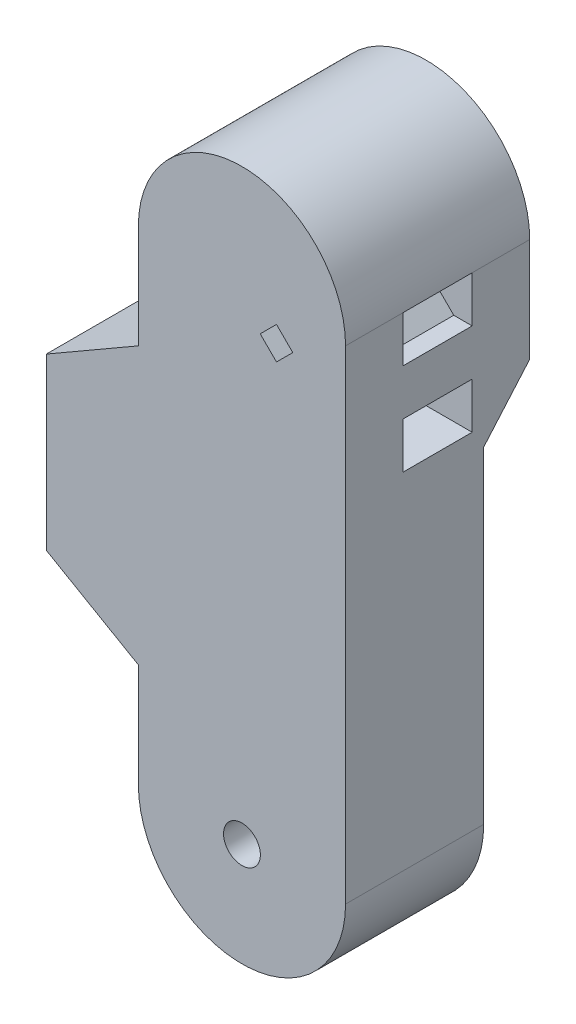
from build123d import *

# Parameters (mm, degrees)
EXTRUDE_1_DEPTH          = 40
CUT_EXTRUDE_3_DEPTH      = 108.004672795
CUT_EXTRUDE_4_DEPTH      = 7.5
CUT_EXTRUDE_5_DEPTH      = 96.032889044
CUT_EXTRUDE_5_DEPTH_BACK = 96.032889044
SKETCH_19_R              = 4
CUT_EXTRUDE_6_DEPTH      = 92.275681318


with BuildPart() as part:
    # Sketch 1 → Extrude 1 (new body)
    with BuildSketch(Plane.XY):
        Polygon((-42.5, -18.452994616), (-22.5, -30), (-22.5, 30), (-42.5, 18.452994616), align=None)
        with BuildLine():
            Line((22.5, -52.5), (22.5, 52.5))
            ThreePointArc((22.5, 52.5), (0, 75), (-22.5, 52.5))
            Line((-22.5, 52.5), (-22.5, -52.5))
            ThreePointArc((-22.5, -52.5), (0, -75), (22.5, -52.5))
        make_face()
    extrude(amount=EXTRUDE_1_DEPTH)

    # Sketch 15 → Cut-Extrude 3 (cut, through all)
    with BuildSketch(Plane.ZY.offset(42.5)):
        Polygon((10, -75), (0, -75), (0, 18.452994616), (0, 30), (10, 18.452994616), align=None)
    extrude(amount=-CUT_EXTRUDE_3_DEPTH, mode=Mode.SUBTRACT)

    # Sketch 16 → Cut-Extrude 4 (cut, symmetric)
    with BuildSketch(Plane(origin=(0, 0, 20), x_dir=(-1, 0, 0), z_dir=(0, 0, -1))):
        Polygon((-22.5, 52.5), (9.5, 52.5), (2.5, 45.5), (-3.964466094, 45.5), (-7.5, 49.035533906), (-11.035533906, 45.5), (-15.5, 45.5), (-18.5, 42.5), (-22.5, 42.5), align=None)
        Polygon((-22.5, 32.5), (-22.5, 22.5), (9.5, 22.5), (2.5, 29.5), (-3.964466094, 29.5), (-7.5, 25.964466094), (-11.035533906, 29.5), (-15.5, 29.5), (-18.5, 32.5), align=None)
    extrude(amount=CUT_EXTRUDE_4_DEPTH, both=True, mode=Mode.SUBTRACT)

    # Sketch 18 → Cut-Extrude 5 (cut, two sides: drawn at the far end of the back side and taken through both)
    with BuildSketch(Plane(origin=(0, 0, 0), x_dir=(-1, 0, 0), z_dir=(0, 0, -1)).offset(-CUT_EXTRUDE_5_DEPTH_BACK)):
        Polygon((-7.5, 49.035533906), (-11.035533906, 45.5), (-7.5, 41.964466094), (-3.964466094, 45.5), align=None)
    extrude(amount=CUT_EXTRUDE_5_DEPTH + CUT_EXTRUDE_5_DEPTH_BACK, mode=Mode.SUBTRACT)

    # Sketch 19 → Cut-Extrude 6 (cut, through all)
    with BuildSketch(Plane(origin=(0, 0, 10), x_dir=(-1, 0, 0), z_dir=(0, 0, -1))):
        with Locations(Location((0, -52.5, 0), (0, 0, 90))):
            Circle(SKETCH_19_R)
    extrude(amount=-CUT_EXTRUDE_6_DEPTH, mode=Mode.SUBTRACT)


solid = part.part
